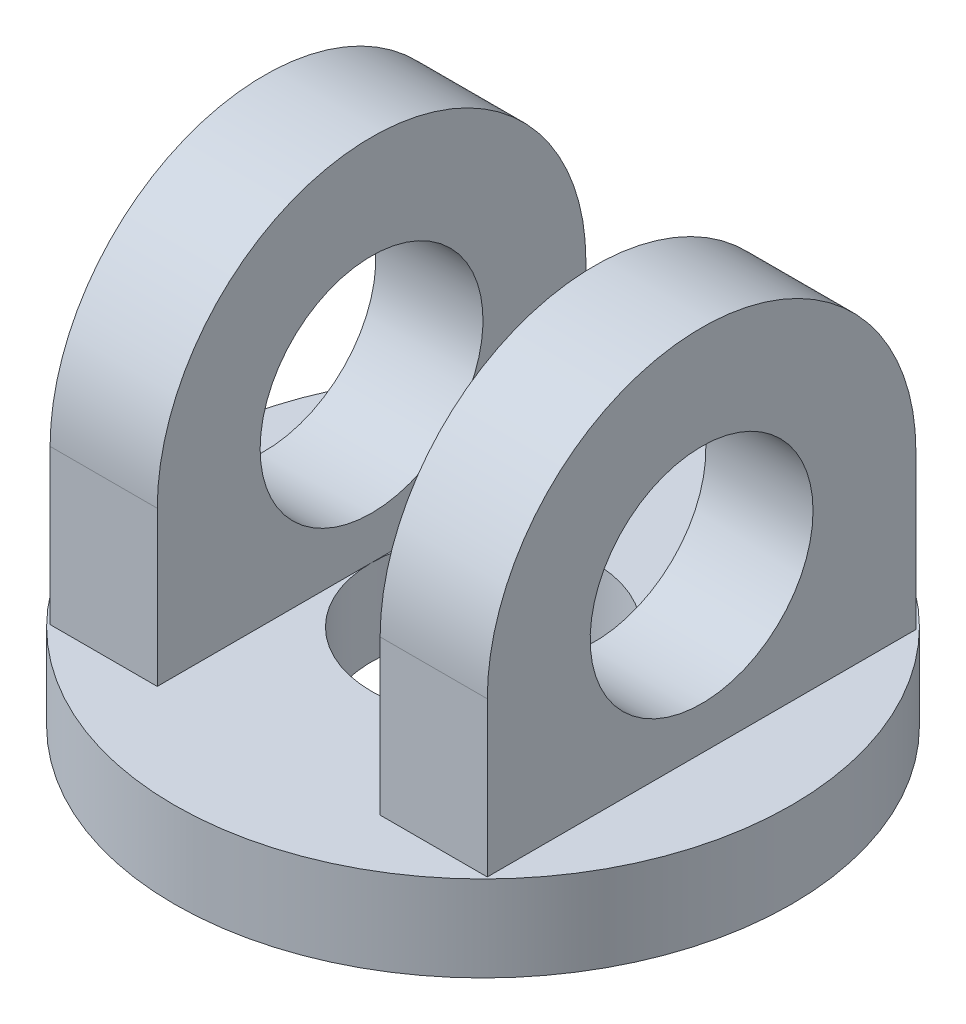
ISO-10303-21;
HEADER;
FILE_DESCRIPTION(('STEP AP214'),'2;1');
FILE_NAME('part.step','',(''),(''),'','','');
FILE_SCHEMA(('AUTOMOTIVE_DESIGN { 1 0 10303 214 1 1 1 1 }'));
ENDSEC;
DATA;
#1=APPLICATION_CONTEXT('core data for automotive mechanical design processes');
#2=APPLICATION_PROTOCOL_DEFINITION('international standard','automotive_design',2000,#1);
#3=PRODUCT_CONTEXT('',#1,'mechanical');
#4=PRODUCT('Part','Part','',(#3));
#5=PRODUCT_RELATED_PRODUCT_CATEGORY('part','',(#4));
#6=PRODUCT_DEFINITION_FORMATION('','',#4);
#7=PRODUCT_DEFINITION_CONTEXT('part definition',#1,'design');
#8=PRODUCT_DEFINITION('design','',#6,#7);
#9=PRODUCT_DEFINITION_SHAPE('','',#8);
#10=(LENGTH_UNIT() NAMED_UNIT(*) SI_UNIT(.MILLI.,.METRE.));
#11=(NAMED_UNIT(*) PLANE_ANGLE_UNIT() SI_UNIT($,.RADIAN.));
#12=(NAMED_UNIT(*) SI_UNIT($,.STERADIAN.) SOLID_ANGLE_UNIT());
#13=UNCERTAINTY_MEASURE_WITH_UNIT(LENGTH_MEASURE(1.E-05),#10,'distance_accuracy_value','');
#14=(GEOMETRIC_REPRESENTATION_CONTEXT(3) GLOBAL_UNCERTAINTY_ASSIGNED_CONTEXT((#13)) GLOBAL_UNIT_ASSIGNED_CONTEXT((#10,
#11,#12)) REPRESENTATION_CONTEXT('',''));
#15=CARTESIAN_POINT('',(0.,0.,0.));
#16=DIRECTION('',(0.,0.,1.));
#17=DIRECTION('',(1.,0.,0.));
#18=AXIS2_PLACEMENT_3D('',#15,#16,#17);
#19=CARTESIAN_POINT('',(-51.,20.,50.));
#20=DIRECTION('',(0.,0.,1.));
#21=DIRECTION('',(1.,0.,0.));
#22=AXIS2_PLACEMENT_3D('',#19,#20,#21);
#23=PLANE('',#22);
#24=DIRECTION('',(0.,-1.,0.));
#25=VECTOR('',#24,1.);
#26=CARTESIAN_POINT('',(-26.,20.,50.));
#27=LINE('',#26,#25);
#28=CARTESIAN_POINT('',(-26.,56.,50.));
#29=VERTEX_POINT('',#28);
#30=CARTESIAN_POINT('',(-26.,20.,50.));
#31=VERTEX_POINT('',#30);
#32=EDGE_CURVE('E134',#29,#31,#27,.T.);
#33=ORIENTED_EDGE('',*,*,#32,.F.);
#34=DIRECTION('',(1.,0.,0.));
#35=VECTOR('',#34,1.);
#36=CARTESIAN_POINT('',(-51.,56.,50.));
#37=LINE('',#36,#35);
#38=CARTESIAN_POINT('',(-51.,56.,50.));
#39=VERTEX_POINT('',#38);
#40=EDGE_CURVE('E160',#39,#29,#37,.T.);
#41=ORIENTED_EDGE('',*,*,#40,.F.);
#42=DIRECTION('',(0.,-1.,0.));
#43=VECTOR('',#42,1.);
#44=CARTESIAN_POINT('',(-51.,20.,50.));
#45=LINE('',#44,#43);
#46=CARTESIAN_POINT('',(-51.,20.,50.));
#47=VERTEX_POINT('',#46);
#48=EDGE_CURVE('E149',#39,#47,#45,.T.);
#49=ORIENTED_EDGE('',*,*,#48,.T.);
#50=DIRECTION('',(1.,0.,0.));
#51=VECTOR('',#50,1.);
#52=CARTESIAN_POINT('',(-51.,20.,50.));
#53=LINE('',#52,#51);
#54=EDGE_CURVE('E172',#47,#31,#53,.T.);
#55=ORIENTED_EDGE('',*,*,#54,.T.);
#56=EDGE_LOOP('',(#33,#41,#49,#55));
#57=FACE_BOUND('',#56,.T.);
#58=ADVANCED_FACE('F31',(#57),#23,.T.);
#59=CARTESIAN_POINT('',(-51.,56.,0.));
#60=DIRECTION('',(1.,0.,0.));
#61=DIRECTION('',(0.,0.,-1.));
#62=AXIS2_PLACEMENT_3D('',#59,#60,#61);
#63=CYLINDRICAL_SURFACE('',#62,50.);
#64=CARTESIAN_POINT('',(-26.,56.,0.));
#65=DIRECTION('',(-1.,0.,0.));
#66=DIRECTION('',(0.,-1.,0.));
#67=AXIS2_PLACEMENT_3D('',#64,#65,#66);
#68=CIRCLE('',#67,50.);
#69=CARTESIAN_POINT('',(-26.,56.,-50.));
#70=VERTEX_POINT('',#69);
#71=EDGE_CURVE('E132',#70,#29,#68,.F.);
#72=ORIENTED_EDGE('',*,*,#71,.F.);
#73=DIRECTION('',(1.,0.,0.));
#74=VECTOR('',#73,1.);
#75=CARTESIAN_POINT('',(-51.,56.,-50.));
#76=LINE('',#75,#74);
#77=CARTESIAN_POINT('',(-51.,56.,-50.));
#78=VERTEX_POINT('',#77);
#79=EDGE_CURVE('E165',#78,#70,#76,.T.);
#80=ORIENTED_EDGE('',*,*,#79,.F.);
#81=CARTESIAN_POINT('',(-51.,56.,0.));
#82=DIRECTION('',(1.,0.,0.));
#83=DIRECTION('',(0.,0.,-1.));
#84=AXIS2_PLACEMENT_3D('',#81,#82,#83);
#85=CIRCLE('',#84,50.);
#86=EDGE_CURVE('E157',#78,#39,#85,.T.);
#87=ORIENTED_EDGE('',*,*,#86,.T.);
#88=ORIENTED_EDGE('',*,*,#40,.T.);
#89=EDGE_LOOP('',(#72,#80,#87,#88));
#90=FACE_BOUND('',#89,.T.);
#91=ADVANCED_FACE('F205',(#90),#63,.T.);
#92=CARTESIAN_POINT('',(-51.,20.,-50.));
#93=DIRECTION('',(0.,0.,-1.));
#94=DIRECTION('',(-1.,0.,0.));
#95=AXIS2_PLACEMENT_3D('',#92,#93,#94);
#96=PLANE('',#95);
#97=DIRECTION('',(0.,1.,0.));
#98=VECTOR('',#97,1.);
#99=CARTESIAN_POINT('',(-26.,20.,-50.));
#100=LINE('',#99,#98);
#101=CARTESIAN_POINT('',(-26.,20.,-50.));
#102=VERTEX_POINT('',#101);
#103=EDGE_CURVE('E11',#102,#70,#100,.T.);
#104=ORIENTED_EDGE('',*,*,#103,.F.);
#105=DIRECTION('',(1.,0.,0.));
#106=VECTOR('',#105,1.);
#107=CARTESIAN_POINT('',(-51.,20.,-50.));
#108=LINE('',#107,#106);
#109=CARTESIAN_POINT('',(-51.,20.,-50.));
#110=VERTEX_POINT('',#109);
#111=EDGE_CURVE('E169',#110,#102,#108,.T.);
#112=ORIENTED_EDGE('',*,*,#111,.F.);
#113=DIRECTION('',(0.,1.,0.));
#114=VECTOR('',#113,1.);
#115=CARTESIAN_POINT('',(-51.,20.,-50.));
#116=LINE('',#115,#114);
#117=EDGE_CURVE('E154',#110,#78,#116,.T.);
#118=ORIENTED_EDGE('',*,*,#117,.T.);
#119=ORIENTED_EDGE('',*,*,#79,.T.);
#120=EDGE_LOOP('',(#104,#112,#118,#119));
#121=FACE_BOUND('',#120,.T.);
#122=ADVANCED_FACE('F212',(#121),#96,.T.);
#123=CARTESIAN_POINT('',(0.,20.,0.));
#124=DIRECTION('',(0.,1.,0.));
#125=DIRECTION('',(0.,0.,1.));
#126=AXIS2_PLACEMENT_3D('',#123,#124,#125);
#127=PLANE('',#126);
#128=CARTESIAN_POINT('',(0.,20.,0.));
#129=DIRECTION('',(0.,1.,0.));
#130=DIRECTION('',(0.,0.,1.));
#131=AXIS2_PLACEMENT_3D('',#128,#129,#130);
#132=CIRCLE('',#131,26.);
#133=CARTESIAN_POINT('',(26.,20.,0.));
#134=VERTEX_POINT('',#133);
#135=CARTESIAN_POINT('',(-26.,20.,0.));
#136=VERTEX_POINT('',#135);
#137=EDGE_CURVE('E47',#134,#136,#132,.T.);
#138=ORIENTED_EDGE('',*,*,#137,.F.);
#139=DIRECTION('',(0.,0.,1.));
#140=VECTOR('',#139,1.);
#141=CARTESIAN_POINT('',(26.,20.,-72.));
#142=LINE('',#141,#140);
#143=CARTESIAN_POINT('',(26.,20.,-50.));
#144=VERTEX_POINT('',#143);
#145=EDGE_CURVE('E54',#144,#134,#142,.T.);
#146=ORIENTED_EDGE('',*,*,#145,.F.);
#147=CARTESIAN_POINT('',(51.,20.,-50.));
#148=VERTEX_POINT('',#147);
#149=EDGE_CURVE('E171',#144,#148,#108,.T.);
#150=ORIENTED_EDGE('',*,*,#149,.T.);
#151=DIRECTION('',(0.,0.,-1.));
#152=VECTOR('',#151,1.);
#153=CARTESIAN_POINT('',(51.,20.,50.));
#154=LINE('',#153,#152);
#155=CARTESIAN_POINT('',(51.,20.,50.));
#156=VERTEX_POINT('',#155);
#157=EDGE_CURVE('E140',#156,#148,#154,.T.);
#158=ORIENTED_EDGE('',*,*,#157,.F.);
#159=CARTESIAN_POINT('',(26.,20.,50.));
#160=VERTEX_POINT('',#159);
#161=EDGE_CURVE('E115',#160,#156,#53,.T.);
#162=ORIENTED_EDGE('',*,*,#161,.F.);
#163=EDGE_CURVE('E113',#134,#160,#142,.T.);
#164=ORIENTED_EDGE('',*,*,#163,.F.);
#165=EDGE_CURVE('E101',#136,#134,#132,.T.);
#166=ORIENTED_EDGE('',*,*,#165,.F.);
#167=DIRECTION('',(0.,0.,1.));
#168=VECTOR('',#167,1.);
#169=CARTESIAN_POINT('',(-26.,20.,-72.));
#170=LINE('',#169,#168);
#171=EDGE_CURVE('E129',#136,#31,#170,.T.);
#172=ORIENTED_EDGE('',*,*,#171,.T.);
#173=ORIENTED_EDGE('',*,*,#54,.F.);
#174=DIRECTION('',(0.,0.,-1.));
#175=VECTOR('',#174,1.);
#176=CARTESIAN_POINT('',(-51.,20.,50.));
#177=LINE('',#176,#175);
#178=EDGE_CURVE('E152',#47,#110,#177,.T.);
#179=ORIENTED_EDGE('',*,*,#178,.T.);
#180=ORIENTED_EDGE('',*,*,#111,.T.);
#181=EDGE_CURVE('E111',#102,#136,#170,.T.);
#182=ORIENTED_EDGE('',*,*,#181,.T.);
#183=EDGE_LOOP('',(#138,#146,#150,#158,#162,#164,#166,#172,#173,#179,#180,#182));
#184=FACE_BOUND('',#183,.T.);
#185=CARTESIAN_POINT('',(0.,20.,0.));
#186=DIRECTION('',(0.,1.,0.));
#187=DIRECTION('',(0.,0.,1.));
#188=AXIS2_PLACEMENT_3D('',#185,#186,#187);
#189=CIRCLE('',#188,72.);
#190=CARTESIAN_POINT('',(0.,20.,72.));
#191=VERTEX_POINT('',#190);
#192=EDGE_CURVE('E175',#191,#191,#189,.T.);
#193=ORIENTED_EDGE('',*,*,#192,.T.);
#194=EDGE_LOOP('',(#193));
#195=FACE_BOUND('',#194,.T.);
#196=ADVANCED_FACE('F108',(#184,#195),#127,.T.);
#197=CARTESIAN_POINT('',(0.,20.,0.));
#198=DIRECTION('',(0.,-1.,0.));
#199=DIRECTION('',(0.,0.,-1.));
#200=AXIS2_PLACEMENT_3D('',#197,#198,#199);
#201=CYLINDRICAL_SURFACE('',#200,72.);
#202=ORIENTED_EDGE('',*,*,#192,.F.);
#203=EDGE_LOOP('',(#202));
#204=FACE_BOUND('',#203,.T.);
#205=CARTESIAN_POINT('',(0.,0.,0.));
#206=DIRECTION('',(0.,1.,0.));
#207=DIRECTION('',(0.,0.,1.));
#208=AXIS2_PLACEMENT_3D('',#205,#206,#207);
#209=CIRCLE('',#208,72.);
#210=CARTESIAN_POINT('',(0.,0.,72.));
#211=VERTEX_POINT('',#210);
#212=EDGE_CURVE('E163',#211,#211,#209,.T.);
#213=ORIENTED_EDGE('',*,*,#212,.T.);
#214=EDGE_LOOP('',(#213));
#215=FACE_BOUND('',#214,.T.);
#216=ADVANCED_FACE('F33',(#204,#215),#201,.T.);
#217=CARTESIAN_POINT('',(0.,0.,0.));
#218=DIRECTION('',(0.,1.,0.));
#219=DIRECTION('',(0.,0.,1.));
#220=AXIS2_PLACEMENT_3D('',#217,#218,#219);
#221=PLANE('',#220);
#222=CARTESIAN_POINT('',(0.,0.,0.));
#223=DIRECTION('',(0.,1.,0.));
#224=DIRECTION('',(0.,0.,1.));
#225=AXIS2_PLACEMENT_3D('',#222,#223,#224);
#226=CIRCLE('',#225,26.);
#227=CARTESIAN_POINT('',(0.,0.,26.));
#228=VERTEX_POINT('',#227);
#229=EDGE_CURVE('E35',#228,#228,#226,.T.);
#230=ORIENTED_EDGE('',*,*,#229,.T.);
#231=EDGE_LOOP('',(#230));
#232=FACE_BOUND('',#231,.T.);
#233=ORIENTED_EDGE('',*,*,#212,.F.);
#234=EDGE_LOOP('',(#233));
#235=FACE_BOUND('',#234,.T.);
#236=ADVANCED_FACE('F194',(#232,#235),#221,.F.);
#237=DIRECTION('',(0.,1.,0.));
#238=VECTOR('',#237,1.);
#239=CARTESIAN_POINT('',(26.,20.,50.));
#240=LINE('',#239,#238);
#241=CARTESIAN_POINT('',(26.,56.,50.));
#242=VERTEX_POINT('',#241);
#243=EDGE_CURVE('E123',#160,#242,#240,.T.);
#244=ORIENTED_EDGE('',*,*,#243,.F.);
#245=ORIENTED_EDGE('',*,*,#161,.T.);
#246=DIRECTION('',(0.,-1.,0.));
#247=VECTOR('',#246,1.);
#248=CARTESIAN_POINT('',(51.,20.,50.));
#249=LINE('',#248,#247);
#250=CARTESIAN_POINT('',(51.,56.,50.));
#251=VERTEX_POINT('',#250);
#252=EDGE_CURVE('E137',#251,#156,#249,.T.);
#253=ORIENTED_EDGE('',*,*,#252,.F.);
#254=EDGE_CURVE('E164',#242,#251,#37,.T.);
#255=ORIENTED_EDGE('',*,*,#254,.F.);
#256=EDGE_LOOP('',(#244,#245,#253,#255));
#257=FACE_BOUND('',#256,.T.);
#258=ADVANCED_FACE('F208',(#257),#23,.T.);
#259=CARTESIAN_POINT('',(26.,56.,-50.));
#260=VERTEX_POINT('',#259);
#261=CARTESIAN_POINT('',(51.,56.,-50.));
#262=VERTEX_POINT('',#261);
#263=EDGE_CURVE('E168',#260,#262,#76,.T.);
#264=ORIENTED_EDGE('',*,*,#263,.F.);
#265=CARTESIAN_POINT('',(26.,56.,0.));
#266=DIRECTION('',(1.,0.,0.));
#267=DIRECTION('',(0.,1.,0.));
#268=AXIS2_PLACEMENT_3D('',#265,#266,#267);
#269=CIRCLE('',#268,50.);
#270=EDGE_CURVE('E122',#242,#260,#269,.F.);
#271=ORIENTED_EDGE('',*,*,#270,.F.);
#272=ORIENTED_EDGE('',*,*,#254,.T.);
#273=CARTESIAN_POINT('',(51.,56.,0.));
#274=DIRECTION('',(1.,0.,0.));
#275=DIRECTION('',(0.,0.,-1.));
#276=AXIS2_PLACEMENT_3D('',#273,#274,#275);
#277=CIRCLE('',#276,50.);
#278=EDGE_CURVE('E146',#262,#251,#277,.T.);
#279=ORIENTED_EDGE('',*,*,#278,.F.);
#280=EDGE_LOOP('',(#264,#271,#272,#279));
#281=FACE_BOUND('',#280,.T.);
#282=ADVANCED_FACE('F215',(#281),#63,.T.);
#283=DIRECTION('',(0.,-1.,0.));
#284=VECTOR('',#283,1.);
#285=CARTESIAN_POINT('',(26.,20.,-50.));
#286=LINE('',#285,#284);
#287=EDGE_CURVE('E40',#260,#144,#286,.T.);
#288=ORIENTED_EDGE('',*,*,#287,.F.);
#289=ORIENTED_EDGE('',*,*,#263,.T.);
#290=DIRECTION('',(0.,1.,0.));
#291=VECTOR('',#290,1.);
#292=CARTESIAN_POINT('',(51.,20.,-50.));
#293=LINE('',#292,#291);
#294=EDGE_CURVE('E143',#148,#262,#293,.T.);
#295=ORIENTED_EDGE('',*,*,#294,.F.);
#296=ORIENTED_EDGE('',*,*,#149,.F.);
#297=EDGE_LOOP('',(#288,#289,#295,#296));
#298=FACE_BOUND('',#297,.T.);
#299=ADVANCED_FACE('F225',(#298),#96,.T.);
#300=CARTESIAN_POINT('',(-51.,56.,0.));
#301=DIRECTION('',(1.,0.,0.));
#302=DIRECTION('',(0.,0.,-1.));
#303=AXIS2_PLACEMENT_3D('',#300,#301,#302);
#304=PLANE('',#303);
#305=CARTESIAN_POINT('',(-51.,56.,0.));
#306=DIRECTION('',(-1.,0.,0.));
#307=DIRECTION('',(0.,0.,1.));
#308=AXIS2_PLACEMENT_3D('',#305,#306,#307);
#309=CIRCLE('',#308,26.);
#310=CARTESIAN_POINT('',(-51.,56.,26.));
#311=VERTEX_POINT('',#310);
#312=EDGE_CURVE('E183',#311,#311,#309,.T.);
#313=ORIENTED_EDGE('',*,*,#312,.F.);
#314=EDGE_LOOP('',(#313));
#315=FACE_BOUND('',#314,.T.);
#316=ORIENTED_EDGE('',*,*,#48,.F.);
#317=ORIENTED_EDGE('',*,*,#86,.F.);
#318=ORIENTED_EDGE('',*,*,#117,.F.);
#319=ORIENTED_EDGE('',*,*,#178,.F.);
#320=EDGE_LOOP('',(#316,#317,#318,#319));
#321=FACE_BOUND('',#320,.T.);
#322=ADVANCED_FACE('F238',(#315,#321),#304,.F.);
#323=CARTESIAN_POINT('',(51.,56.,0.));
#324=DIRECTION('',(1.,0.,0.));
#325=DIRECTION('',(0.,0.,-1.));
#326=AXIS2_PLACEMENT_3D('',#323,#324,#325);
#327=PLANE('',#326);
#328=CARTESIAN_POINT('',(51.,56.,0.));
#329=DIRECTION('',(1.,0.,0.));
#330=DIRECTION('',(0.,0.,-1.));
#331=AXIS2_PLACEMENT_3D('',#328,#329,#330);
#332=CIRCLE('',#331,26.);
#333=CARTESIAN_POINT('',(51.,56.,-26.));
#334=VERTEX_POINT('',#333);
#335=EDGE_CURVE('E127',#334,#334,#332,.T.);
#336=ORIENTED_EDGE('',*,*,#335,.F.);
#337=EDGE_LOOP('',(#336));
#338=FACE_BOUND('',#337,.T.);
#339=ORIENTED_EDGE('',*,*,#252,.T.);
#340=ORIENTED_EDGE('',*,*,#157,.T.);
#341=ORIENTED_EDGE('',*,*,#294,.T.);
#342=ORIENTED_EDGE('',*,*,#278,.T.);
#343=EDGE_LOOP('',(#339,#340,#341,#342));
#344=FACE_BOUND('',#343,.T.);
#345=ADVANCED_FACE('F235',(#338,#344),#327,.T.);
#346=CARTESIAN_POINT('',(-26.,106.,-72.));
#347=DIRECTION('',(-1.,0.,0.));
#348=DIRECTION('',(0.,-1.,0.));
#349=AXIS2_PLACEMENT_3D('',#346,#347,#348);
#350=PLANE('',#349);
#351=CARTESIAN_POINT('',(-26.,56.,0.));
#352=DIRECTION('',(-1.,0.,0.));
#353=DIRECTION('',(0.,-1.,0.));
#354=AXIS2_PLACEMENT_3D('',#351,#352,#353);
#355=CIRCLE('',#354,26.);
#356=CARTESIAN_POINT('',(-26.,30.,0.));
#357=VERTEX_POINT('',#356);
#358=EDGE_CURVE('E182',#357,#357,#355,.T.);
#359=ORIENTED_EDGE('',*,*,#358,.T.);
#360=EDGE_LOOP('',(#359));
#361=FACE_BOUND('',#360,.T.);
#362=ORIENTED_EDGE('',*,*,#32,.T.);
#363=ORIENTED_EDGE('',*,*,#171,.F.);
#364=ORIENTED_EDGE('',*,*,#181,.F.);
#365=ORIENTED_EDGE('',*,*,#103,.T.);
#366=ORIENTED_EDGE('',*,*,#71,.T.);
#367=EDGE_LOOP('',(#362,#363,#364,#365,#366));
#368=FACE_BOUND('',#367,.T.);
#369=ADVANCED_FACE('F237',(#361,#368),#350,.F.);
#370=CARTESIAN_POINT('',(26.,106.,-72.));
#371=DIRECTION('',(1.,0.,0.));
#372=DIRECTION('',(0.,1.,0.));
#373=AXIS2_PLACEMENT_3D('',#370,#371,#372);
#374=PLANE('',#373);
#375=CARTESIAN_POINT('',(26.,56.,0.));
#376=DIRECTION('',(1.,0.,0.));
#377=DIRECTION('',(0.,1.,0.));
#378=AXIS2_PLACEMENT_3D('',#375,#376,#377);
#379=CIRCLE('',#378,26.);
#380=CARTESIAN_POINT('',(26.,82.,0.));
#381=VERTEX_POINT('',#380);
#382=EDGE_CURVE('E180',#381,#381,#379,.T.);
#383=ORIENTED_EDGE('',*,*,#382,.T.);
#384=EDGE_LOOP('',(#383));
#385=FACE_BOUND('',#384,.T.);
#386=ORIENTED_EDGE('',*,*,#243,.T.);
#387=ORIENTED_EDGE('',*,*,#270,.T.);
#388=ORIENTED_EDGE('',*,*,#287,.T.);
#389=ORIENTED_EDGE('',*,*,#145,.T.);
#390=ORIENTED_EDGE('',*,*,#163,.T.);
#391=EDGE_LOOP('',(#386,#387,#388,#389,#390));
#392=FACE_BOUND('',#391,.T.);
#393=ADVANCED_FACE('F119',(#385,#392),#374,.F.);
#394=CARTESIAN_POINT('',(72.,56.,0.));
#395=DIRECTION('',(-1.,0.,0.));
#396=DIRECTION('',(0.,0.,1.));
#397=AXIS2_PLACEMENT_3D('',#394,#395,#396);
#398=CYLINDRICAL_SURFACE('',#397,26.);
#399=ORIENTED_EDGE('',*,*,#335,.T.);
#400=EDGE_LOOP('',(#399));
#401=FACE_BOUND('',#400,.T.);
#402=ORIENTED_EDGE('',*,*,#382,.F.);
#403=EDGE_LOOP('',(#402));
#404=FACE_BOUND('',#403,.T.);
#405=ADVANCED_FACE('F202',(#401,#404),#398,.F.);
#406=ORIENTED_EDGE('',*,*,#312,.T.);
#407=EDGE_LOOP('',(#406));
#408=FACE_BOUND('',#407,.T.);
#409=ORIENTED_EDGE('',*,*,#358,.F.);
#410=EDGE_LOOP('',(#409));
#411=FACE_BOUND('',#410,.T.);
#412=ADVANCED_FACE('F197',(#408,#411),#398,.F.);
#413=CARTESIAN_POINT('',(0.,-82.,0.));
#414=DIRECTION('',(0.,1.,0.));
#415=DIRECTION('',(0.,0.,1.));
#416=AXIS2_PLACEMENT_3D('',#413,#414,#415);
#417=CYLINDRICAL_SURFACE('',#416,26.);
#418=ORIENTED_EDGE('',*,*,#137,.T.);
#419=ORIENTED_EDGE('',*,*,#165,.T.);
#420=EDGE_LOOP('',(#418,#419));
#421=FACE_BOUND('',#420,.T.);
#422=ORIENTED_EDGE('',*,*,#229,.F.);
#423=EDGE_LOOP('',(#422));
#424=FACE_BOUND('',#423,.T.);
#425=ADVANCED_FACE('F102',(#421,#424),#417,.F.);
#426=CLOSED_SHELL('',(#58,#91,#122,#196,#216,#236,#258,#282,#299,#322,#345,#369,#393,#405,#412,#425));
#427=MANIFOLD_SOLID_BREP('B2',#426);
#428=ADVANCED_BREP_SHAPE_REPRESENTATION('',(#18,#427),#14);
#429=SHAPE_DEFINITION_REPRESENTATION(#9,#428);
ENDSEC;
END-ISO-10303-21;
